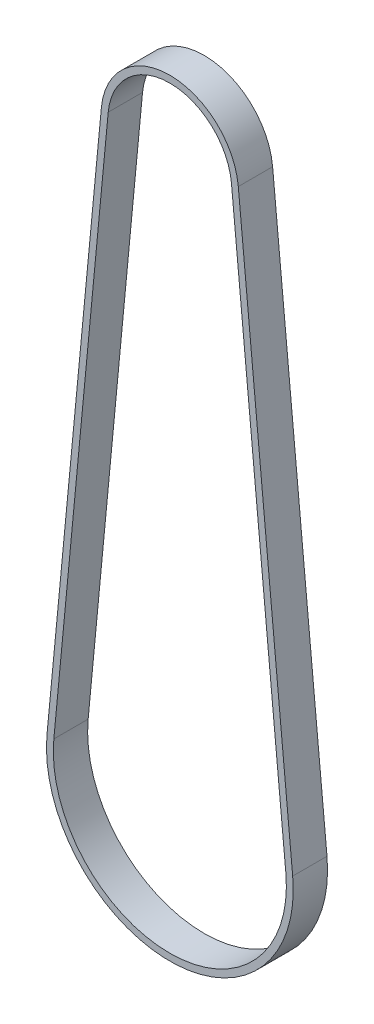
from build123d import *

# Parameters (mm, degrees)
EXTRUSION1_DEPTH = 15


with BuildPart() as part:
    # Esquisse1 → Extrusion1 (new body)
    with BuildSketch(Plane.XY):
        with BuildLine():
            Line((29.91912818, 254.224609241), (53.686194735, 5.122245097))
            ThreePointArc((53.686194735, 5.122245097), (0, -53.93), (-53.686194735, 5.122245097))
            Line((-53.686194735, 5.122245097), (-29.91912818, 254.224609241))
            ThreePointArc((-29.91912818, 254.224609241), (0, 281.425), (29.91912818, 254.224609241))
        make_face()
        with BuildLine():
            Line((26.932690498, 253.939670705), (50.699757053, 4.83730656))
            ThreePointArc((50.699757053, 4.83730656), (0, -50.93), (-50.699757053, 4.83730656))
            Line((-50.699757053, 4.83730656), (-26.932690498, 253.939670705))
            ThreePointArc((-26.932690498, 253.939670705), (0, 278.425), (26.932690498, 253.939670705))
        make_face(mode=Mode.SUBTRACT)
    extrude(amount=-EXTRUSION1_DEPTH)


solid = part.part
